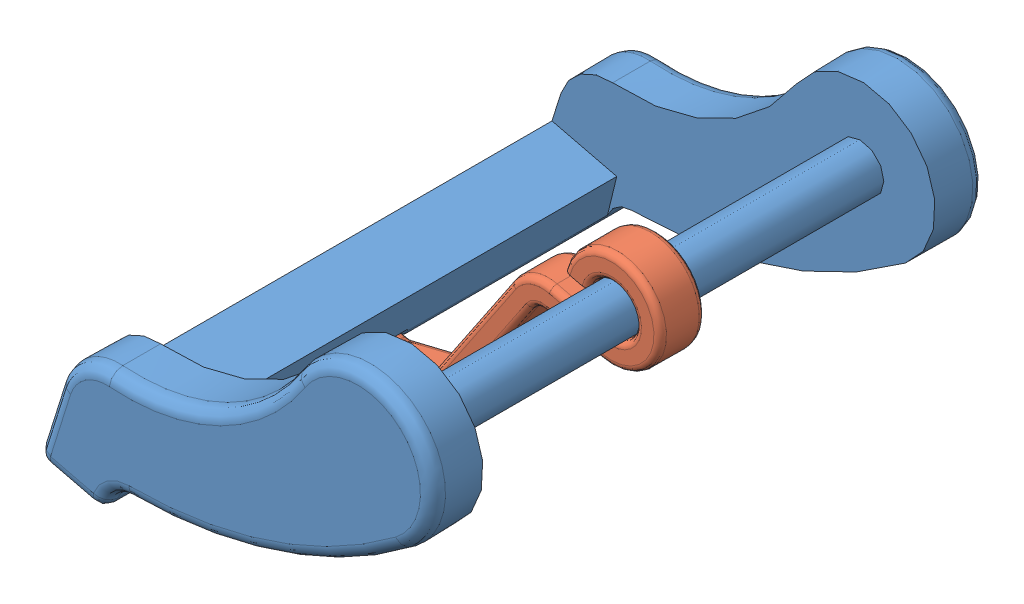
SolidWorks assembly LatchAssy.sldasm, configuration Default (file format 13000). Lengths in mm.
Overall size (15.73 14.35 22).
2 component instances, 2 part files, 0 mates.
Components (placement in the parent):
- latch-1: latch.SLDPRT [Default] at origin size (15.73 10 22)
- latchpin-1: latchpin.SLDPRT [Default] at (-13.2902 -54.7671 0) x (0.971796 -0.235824 0) z (-0.235824 -0.971796 0) size (12.45 1.8 11.74)
